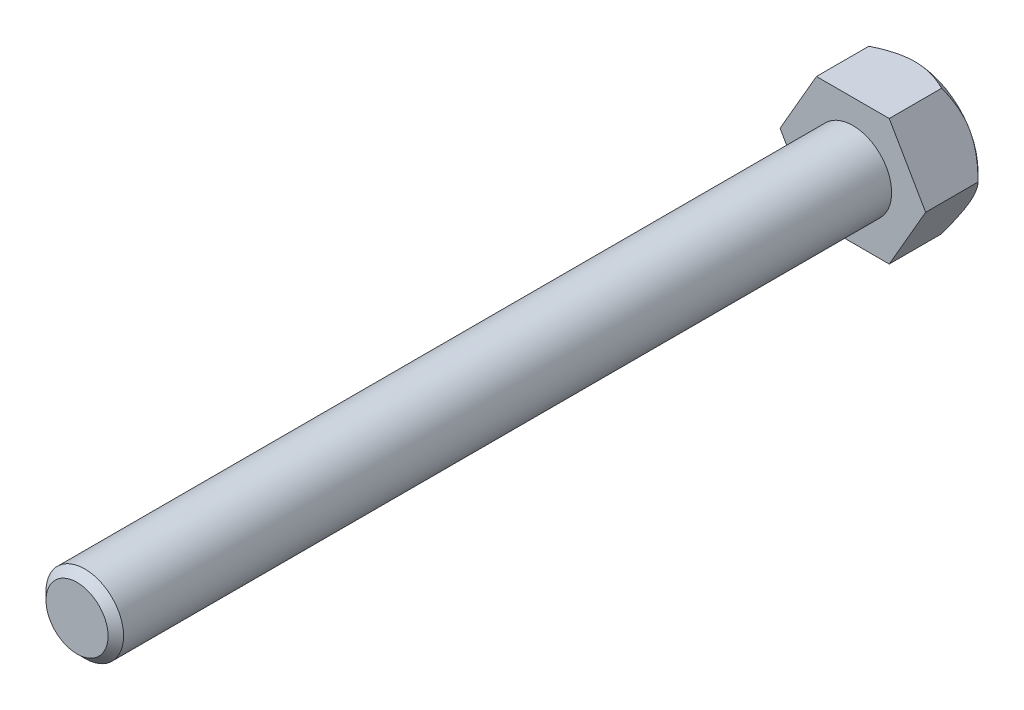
ISO-10303-21;
HEADER;
FILE_DESCRIPTION(('STEP AP214'),'2;1');
FILE_NAME('part.step','',(''),(''),'','','');
FILE_SCHEMA(('AUTOMOTIVE_DESIGN { 1 0 10303 214 1 1 1 1 }'));
ENDSEC;
DATA;
#1=APPLICATION_CONTEXT('core data for automotive mechanical design processes');
#2=APPLICATION_PROTOCOL_DEFINITION('international standard','automotive_design',2000,#1);
#3=PRODUCT_CONTEXT('',#1,'mechanical');
#4=PRODUCT('Part','Part','',(#3));
#5=PRODUCT_RELATED_PRODUCT_CATEGORY('part','',(#4));
#6=PRODUCT_DEFINITION_FORMATION('','',#4);
#7=PRODUCT_DEFINITION_CONTEXT('part definition',#1,'design');
#8=PRODUCT_DEFINITION('design','',#6,#7);
#9=PRODUCT_DEFINITION_SHAPE('','',#8);
#10=(LENGTH_UNIT() NAMED_UNIT(*) SI_UNIT(.MILLI.,.METRE.));
#11=(NAMED_UNIT(*) PLANE_ANGLE_UNIT() SI_UNIT($,.RADIAN.));
#12=(NAMED_UNIT(*) SI_UNIT($,.STERADIAN.) SOLID_ANGLE_UNIT());
#13=UNCERTAINTY_MEASURE_WITH_UNIT(LENGTH_MEASURE(1.E-05),#10,'distance_accuracy_value','');
#14=(GEOMETRIC_REPRESENTATION_CONTEXT(3) GLOBAL_UNCERTAINTY_ASSIGNED_CONTEXT((#13)) GLOBAL_UNIT_ASSIGNED_CONTEXT((#10,
#11,#12)) REPRESENTATION_CONTEXT('',''));
#15=CARTESIAN_POINT('',(0.,0.,0.));
#16=DIRECTION('',(0.,0.,1.));
#17=DIRECTION('',(1.,0.,0.));
#18=AXIS2_PLACEMENT_3D('',#15,#16,#17);
#19=CARTESIAN_POINT('',(3.75277674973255,-6.50000000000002,6.4));
#20=DIRECTION('',(-0.866025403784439,0.499999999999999,0.));
#21=DIRECTION('',(-0.499999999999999,-0.866025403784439,0.));
#22=AXIS2_PLACEMENT_3D('',#19,#20,#21);
#23=PLANE('',#22);
#24=CARTESIAN_POINT('',(10.1286443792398,4.54332667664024,4.5954038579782));
#25=CARTESIAN_POINT('',(10.039761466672,4.38937695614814,4.45131536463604));
#26=CARTESIAN_POINT('',(9.95052655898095,4.23481756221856,4.30808756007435));
#27=CARTESIAN_POINT('',(9.77123095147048,3.92426846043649,4.023682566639));
#28=CARTESIAN_POINT('',(9.68117017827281,3.76827862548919,3.88250556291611));
#29=CARTESIAN_POINT('',(9.49990390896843,3.45431623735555,3.60222798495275));
#30=CARTESIAN_POINT('',(9.40869621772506,3.29633988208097,3.46313307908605));
#31=CARTESIAN_POINT('',(9.2252068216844,2.9785269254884,3.18781210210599));
#32=CARTESIAN_POINT('',(9.13292514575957,2.81869037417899,3.05158595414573));
#33=CARTESIAN_POINT('',(8.94456358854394,2.49243858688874,2.77884830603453));
#34=CARTESIAN_POINT('',(8.84844908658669,2.3259633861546,2.64243221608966));
#35=CARTESIAN_POINT('',(8.65470525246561,1.99038922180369,2.37397618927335));
#36=CARTESIAN_POINT('',(8.5570759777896,1.82129035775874,2.24193608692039));
#37=CARTESIAN_POINT('',(8.36013893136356,1.4801853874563,1.98331100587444));
#38=CARTESIAN_POINT('',(8.26083264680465,1.30818185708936,1.85672151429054));
#39=CARTESIAN_POINT('',(8.0601982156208,0.960672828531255,1.61014921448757));
#40=CARTESIAN_POINT('',(7.95887032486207,0.785167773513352,1.49016557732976));
#41=CARTESIAN_POINT('',(7.75111491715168,0.425324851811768,1.25527867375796));
#42=CARTESIAN_POINT('',(7.64462356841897,0.240876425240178,1.14059973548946));
#43=CARTESIAN_POINT('',(7.42883796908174,-0.132875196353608,0.922141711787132));
#44=CARTESIAN_POINT('',(7.31954332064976,-0.322179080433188,0.818364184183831));
#45=CARTESIAN_POINT('',(7.09850568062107,-0.705027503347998,0.625122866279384));
#46=CARTESIAN_POINT('',(6.98677906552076,-0.898543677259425,0.535584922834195));
#47=CARTESIAN_POINT('',(6.7602534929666,-1.29089747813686,0.373601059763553));
#48=CARTESIAN_POINT('',(6.64545547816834,-1.48973347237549,0.301149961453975));
#49=CARTESIAN_POINT('',(6.43587432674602,-1.85273867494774,0.189275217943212));
#50=CARTESIAN_POINT('',(6.3415866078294,-2.0160497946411,0.14615995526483));
#51=CARTESIAN_POINT('',(6.15157362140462,-2.34516194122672,0.0752392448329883));
#52=CARTESIAN_POINT('',(6.05584856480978,-2.51096260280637,0.0474315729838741));
#53=CARTESIAN_POINT('',(5.86371262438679,-2.84375181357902,0.0085538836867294));
#54=CARTESIAN_POINT('',(5.7673032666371,-3.01073771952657,-0.00254587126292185));
#55=CARTESIAN_POINT('',(5.57437094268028,-3.34490630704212,-0.00749252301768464));
#56=CARTESIAN_POINT('',(5.47784797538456,-3.51208899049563,-0.00133925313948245));
#57=CARTESIAN_POINT('',(5.2856965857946,-3.8449049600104,0.027841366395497));
#58=CARTESIAN_POINT('',(5.19006652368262,-4.01054108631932,0.0508262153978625));
#59=CARTESIAN_POINT('',(5.00008490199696,-4.33959890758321,0.112436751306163));
#60=CARTESIAN_POINT('',(4.90573344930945,-4.5030204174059,0.151063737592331));
#61=CARTESIAN_POINT('',(4.71846263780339,-4.82738297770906,0.242364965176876));
#62=CARTESIAN_POINT('',(4.62554849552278,-4.98831499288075,0.295081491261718));
#63=CARTESIAN_POINT('',(4.44167070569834,-5.30680066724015,0.412553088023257));
#64=CARTESIAN_POINT('',(4.35070696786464,-5.4643544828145,0.477307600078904));
#65=CARTESIAN_POINT('',(4.13900239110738,-5.83103756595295,0.641610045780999));
#66=CARTESIAN_POINT('',(4.01908237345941,-6.03874512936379,0.745371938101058));
#67=CARTESIAN_POINT('',(3.78262258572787,-6.44830549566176,0.967414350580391));
#68=CARTESIAN_POINT('',(3.66608473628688,-6.65015497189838,1.08570292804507));
#69=CARTESIAN_POINT('',(3.43582542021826,-7.04897580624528,1.33378668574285));
#70=CARTESIAN_POINT('',(3.32211026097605,-7.24593623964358,1.46360510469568));
#71=CARTESIAN_POINT('',(3.09735084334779,-7.63523097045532,1.73203397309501));
#72=CARTESIAN_POINT('',(2.98630610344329,-7.82756610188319,1.87064282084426));
#73=CARTESIAN_POINT('',(2.76596059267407,-8.2092157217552,2.15547245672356));
#74=CARTESIAN_POINT('',(2.65667036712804,-8.39851194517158,2.30172572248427));
#75=CARTESIAN_POINT('',(2.44001623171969,-8.77376791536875,2.59982788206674));
#76=CARTESIAN_POINT('',(2.33265239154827,-8.95972754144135,2.75167697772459));
#77=CARTESIAN_POINT('',(2.11967159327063,-9.32862110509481,3.05972608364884));
#78=CARTESIAN_POINT('',(2.01405293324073,-9.51155799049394,3.21592140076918));
#79=CARTESIAN_POINT('',(1.80420589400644,-9.87502372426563,3.53198602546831));
#80=CARTESIAN_POINT('',(1.69997748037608,-10.0555526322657,3.69185524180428));
#81=CARTESIAN_POINT('',(1.5177627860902,-10.3711577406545,3.97561023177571));
#82=CARTESIAN_POINT('',(1.4395245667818,-10.5066703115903,4.09885061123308));
#83=CARTESIAN_POINT('',(1.28399947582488,-10.7760476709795,4.34631576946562));
#84=CARTESIAN_POINT('',(1.20670993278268,-10.9099170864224,4.47053382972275));
#85=CARTESIAN_POINT('',(1.12968586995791,-11.0433266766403,4.59540385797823));
#86=B_SPLINE_CURVE_WITH_KNOTS('',3,(#24,#25,#26,#27,#28,#29,#30,#31,#32,#33,#34,#35,#36,#37,#38,
#39,#40,#41,#42,#43,#44,#45,#46,#47,#48,#49,#50,#51,#52,#53,#54,#55,#56,#57,#58,#59,#60,#61,#62,
#63,#64,#65,#66,#67,#68,#69,#70,#71,#72,#73,#74,#75,#76,#77,#78,#79,#80,#81,#82,#83,#84,#85),
.UNSPECIFIED.,.F.,.F.,(4,2,2,2,2,2,2,2,2,2,2,2,2,2,2,2,2,2,2,2,2,2,2,2,2,2,2,2,2,2,4),(0.,
0.68648817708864,1.37303795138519,2.06120340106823,2.749350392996,3.45644398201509,
4.16351080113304,4.86998047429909,5.57636129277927,6.30179544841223,7.02733312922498,
7.74895922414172,8.47036632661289,9.05013970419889,9.62982882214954,10.2084849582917,
10.7871466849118,11.3643522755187,11.941605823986,12.52061163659,13.0995905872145,
13.8829026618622,14.6666511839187,15.4520168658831,16.2372398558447,17.0261239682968,
17.8150365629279,18.6031280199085,19.3911999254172,19.9887336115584,20.5836377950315),.UNSPECIFIED.);
#87=CARTESIAN_POINT('',(7.50555349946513,0.,0.99999999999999));
#88=VERTEX_POINT('',#87);
#89=CARTESIAN_POINT('',(5.76353991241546,-3.01725604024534,0.));
#90=VERTEX_POINT('',#89);
#91=EDGE_CURVE('E215',#88,#90,#86,.T.);
#92=ORIENTED_EDGE('',*,*,#91,.F.);
#93=DIRECTION('',(0.,0.,-1.));
#94=VECTOR('',#93,1.);
#95=CARTESIAN_POINT('',(7.50555349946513,0.,6.4));
#96=LINE('',#95,#94);
#97=CARTESIAN_POINT('',(7.50555349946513,0.,6.4));
#98=VERTEX_POINT('',#97);
#99=EDGE_CURVE('E161',#98,#88,#96,.T.);
#100=ORIENTED_EDGE('',*,*,#99,.F.);
#101=DIRECTION('',(0.499999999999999,0.866025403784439,0.));
#102=VECTOR('',#101,1.);
#103=CARTESIAN_POINT('',(3.75277674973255,-6.50000000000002,6.4));
#104=LINE('',#103,#102);
#105=CARTESIAN_POINT('',(3.75277674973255,-6.50000000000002,6.4));
#106=VERTEX_POINT('',#105);
#107=EDGE_CURVE('E193',#106,#98,#104,.T.);
#108=ORIENTED_EDGE('',*,*,#107,.F.);
#109=DIRECTION('',(0.,0.,-1.));
#110=VECTOR('',#109,1.);
#111=CARTESIAN_POINT('',(3.75277674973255,-6.50000000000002,6.4));
#112=LINE('',#111,#110);
#113=CARTESIAN_POINT('',(3.75277674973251,-6.50000000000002,0.99999999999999));
#114=VERTEX_POINT('',#113);
#115=EDGE_CURVE('E155',#106,#114,#112,.T.);
#116=ORIENTED_EDGE('',*,*,#115,.T.);
#117=CARTESIAN_POINT('',(5.49479033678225,-3.48274395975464,0.));
#118=VERTEX_POINT('',#117);
#119=EDGE_CURVE('E129',#118,#114,#86,.T.);
#120=ORIENTED_EDGE('',*,*,#119,.F.);
#121=DIRECTION('',(0.499999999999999,0.866025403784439,0.));
#122=VECTOR('',#121,1.);
#123=CARTESIAN_POINT('',(3.75277674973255,-6.50000000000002,0.));
#124=LINE('',#123,#122);
#125=EDGE_CURVE('E212',#118,#90,#124,.T.);
#126=ORIENTED_EDGE('',*,*,#125,.T.);
#127=EDGE_LOOP('',(#92,#100,#108,#116,#120,#126));
#128=FACE_BOUND('',#127,.T.);
#129=ADVANCED_FACE('F31',(#128),#23,.F.);
#130=CARTESIAN_POINT('',(7.50555349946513,0.,6.4));
#131=DIRECTION('',(-0.866025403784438,-0.500000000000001,0.));
#132=DIRECTION('',(0.500000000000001,-0.866025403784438,0.));
#133=AXIS2_PLACEMENT_3D('',#130,#131,#132);
#134=PLANE('',#133);
#135=CARTESIAN_POINT('',(1.12968586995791,11.0433266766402,4.59540385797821));
#136=CARTESIAN_POINT('',(1.21856878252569,10.8893769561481,4.45131536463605));
#137=CARTESIAN_POINT('',(1.30780369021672,10.7348175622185,4.30808756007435));
#138=CARTESIAN_POINT('',(1.4870992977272,10.4242684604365,4.023682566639));
#139=CARTESIAN_POINT('',(1.57716007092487,10.2682786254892,3.88250556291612));
#140=CARTESIAN_POINT('',(1.75842634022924,9.95431623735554,3.60222798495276));
#141=CARTESIAN_POINT('',(1.84963403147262,9.79633988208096,3.46313307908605));
#142=CARTESIAN_POINT('',(2.03312342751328,9.4785269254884,3.187812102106));
#143=CARTESIAN_POINT('',(2.12540510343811,9.31869037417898,3.05158595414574));
#144=CARTESIAN_POINT('',(2.31376666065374,8.99243858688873,2.77884830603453));
#145=CARTESIAN_POINT('',(2.40988116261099,8.82596338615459,2.64243221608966));
#146=CARTESIAN_POINT('',(2.60362499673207,8.49038922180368,2.37397618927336));
#147=CARTESIAN_POINT('',(2.70125427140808,8.32129035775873,2.2419360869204));
#148=CARTESIAN_POINT('',(2.89819131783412,7.98018538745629,1.98331100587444));
#149=CARTESIAN_POINT('',(2.99749760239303,7.80818185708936,1.85672151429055));
#150=CARTESIAN_POINT('',(3.19813203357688,7.46067282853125,1.61014921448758));
#151=CARTESIAN_POINT('',(3.29945992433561,7.28516777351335,1.49016557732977));
#152=CARTESIAN_POINT('',(3.507215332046,6.92532485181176,1.25527867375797));
#153=CARTESIAN_POINT('',(3.61370668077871,6.74087642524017,1.14059973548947));
#154=CARTESIAN_POINT('',(3.82949228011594,6.36712480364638,0.922141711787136));
#155=CARTESIAN_POINT('',(3.93878692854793,6.17782091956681,0.818364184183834));
#156=CARTESIAN_POINT('',(4.15982456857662,5.79497249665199,0.625122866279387));
#157=CARTESIAN_POINT('',(4.27155118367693,5.60145632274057,0.535584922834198));
#158=CARTESIAN_POINT('',(4.49807675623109,5.20910252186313,0.373601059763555));
#159=CARTESIAN_POINT('',(4.61287477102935,5.0102665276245,0.301149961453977));
#160=CARTESIAN_POINT('',(4.82245592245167,4.64726132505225,0.189275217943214));
#161=CARTESIAN_POINT('',(4.91674364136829,4.48395020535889,0.146159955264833));
#162=CARTESIAN_POINT('',(5.10675662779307,4.15483805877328,0.0752392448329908));
#163=CARTESIAN_POINT('',(5.20248168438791,3.98903739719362,0.047431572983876));
#164=CARTESIAN_POINT('',(5.3946176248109,3.65624818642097,0.00855388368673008));
#165=CARTESIAN_POINT('',(5.49102698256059,3.48926228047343,-0.00254587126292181));
#166=CARTESIAN_POINT('',(5.68395930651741,3.15509369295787,-0.00749252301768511));
#167=CARTESIAN_POINT('',(5.78048227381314,2.98791100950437,-0.00133925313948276));
#168=CARTESIAN_POINT('',(5.9726336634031,2.6550950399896,0.0278413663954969));
#169=CARTESIAN_POINT('',(6.06826372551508,2.48945891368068,0.0508262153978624));
#170=CARTESIAN_POINT('',(6.25824534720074,2.16040109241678,0.112436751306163));
#171=CARTESIAN_POINT('',(6.35259679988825,1.99697958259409,0.151063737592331));
#172=CARTESIAN_POINT('',(6.53986761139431,1.67261702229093,0.242364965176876));
#173=CARTESIAN_POINT('',(6.63278175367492,1.51168500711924,0.295081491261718));
#174=CARTESIAN_POINT('',(6.81665954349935,1.19319933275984,0.412553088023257));
#175=CARTESIAN_POINT('',(6.90762328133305,1.0356455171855,0.477307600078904));
#176=CARTESIAN_POINT('',(7.11932785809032,0.66896243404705,0.641610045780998));
#177=CARTESIAN_POINT('',(7.23924787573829,0.461254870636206,0.745371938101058));
#178=CARTESIAN_POINT('',(7.47570766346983,0.0516945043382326,0.96741435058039));
#179=CARTESIAN_POINT('',(7.59224551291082,-0.150154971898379,1.08570292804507));
#180=CARTESIAN_POINT('',(7.82250482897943,-0.548975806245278,1.33378668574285));
#181=CARTESIAN_POINT('',(7.93621998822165,-0.74593623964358,1.46360510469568));
#182=CARTESIAN_POINT('',(8.16097940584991,-1.13523097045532,1.732033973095));
#183=CARTESIAN_POINT('',(8.27202414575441,-1.32756610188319,1.87064282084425));
#184=CARTESIAN_POINT('',(8.49236965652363,-1.70921572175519,2.15547245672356));
#185=CARTESIAN_POINT('',(8.60165988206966,-1.89851194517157,2.30172572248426));
#186=CARTESIAN_POINT('',(8.81831401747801,-2.27376791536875,2.59982788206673));
#187=CARTESIAN_POINT('',(8.92567785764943,-2.45972754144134,2.75167697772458));
#188=CARTESIAN_POINT('',(9.13865865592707,-2.8286211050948,3.05972608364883));
#189=CARTESIAN_POINT('',(9.24427731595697,-3.01155799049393,3.21592140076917));
#190=CARTESIAN_POINT('',(9.45412435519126,-3.37502372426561,3.53198602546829));
#191=CARTESIAN_POINT('',(9.55835276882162,-3.55555263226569,3.69185524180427));
#192=CARTESIAN_POINT('',(9.7405674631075,-3.87115774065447,3.97561023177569));
#193=CARTESIAN_POINT('',(9.81880568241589,-4.00667031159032,4.09885061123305));
#194=CARTESIAN_POINT('',(9.97433077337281,-4.27604767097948,4.34631576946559));
#195=CARTESIAN_POINT('',(10.051620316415,-4.40991708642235,4.47053382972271));
#196=CARTESIAN_POINT('',(10.1286443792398,-4.54332667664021,4.59540385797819));
#197=B_SPLINE_CURVE_WITH_KNOTS('',3,(#135,#136,#137,#138,#139,#140,#141,#142,#143,#144,#145,
#146,#147,#148,#149,#150,#151,#152,#153,#154,#155,#156,#157,#158,#159,#160,#161,#162,#163,#164,
#165,#166,#167,#168,#169,#170,#171,#172,#173,#174,#175,#176,#177,#178,#179,#180,#181,#182,#183,
#184,#185,#186,#187,#188,#189,#190,#191,#192,#193,#194,#195,#196),.UNSPECIFIED.,.F.,.F.,(4,2,2,
2,2,2,2,2,2,2,2,2,2,2,2,2,2,2,2,2,2,2,2,2,2,2,2,2,2,2,4),(0.,0.686488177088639,1.37303795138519,
2.06120340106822,2.749350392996,3.45644398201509,4.16351080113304,4.86998047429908,
5.57636129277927,6.30179544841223,7.02733312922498,7.74895922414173,8.47036632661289,
9.05013970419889,9.62982882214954,10.2084849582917,10.7871466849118,11.3643522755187,
11.941605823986,12.52061163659,13.0995905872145,13.8829026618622,14.6666511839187,
15.4520168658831,16.2372398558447,17.0261239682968,17.8150365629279,18.6031280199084,
19.3911999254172,19.9887336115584,20.5836377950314),.UNSPECIFIED.);
#198=CARTESIAN_POINT('',(3.75277674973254,6.50000000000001,0.99999999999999));
#199=VERTEX_POINT('',#198);
#200=CARTESIAN_POINT('',(5.49479033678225,3.48274395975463,0.));
#201=VERTEX_POINT('',#200);
#202=EDGE_CURVE('E46',#199,#201,#197,.T.);
#203=ORIENTED_EDGE('',*,*,#202,.F.);
#204=DIRECTION('',(0.,0.,-1.));
#205=VECTOR('',#204,1.);
#206=CARTESIAN_POINT('',(3.75277674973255,6.50000000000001,6.4));
#207=LINE('',#206,#205);
#208=CARTESIAN_POINT('',(3.75277674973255,6.50000000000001,6.4));
#209=VERTEX_POINT('',#208);
#210=EDGE_CURVE('E152',#209,#199,#207,.T.);
#211=ORIENTED_EDGE('',*,*,#210,.F.);
#212=DIRECTION('',(-0.500000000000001,0.866025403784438,0.));
#213=VECTOR('',#212,1.);
#214=CARTESIAN_POINT('',(7.50555349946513,0.,6.4));
#215=LINE('',#214,#213);
#216=EDGE_CURVE('E415',#98,#209,#215,.T.);
#217=ORIENTED_EDGE('',*,*,#216,.F.);
#218=ORIENTED_EDGE('',*,*,#99,.T.);
#219=CARTESIAN_POINT('',(5.76353991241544,3.01725604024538,0.));
#220=VERTEX_POINT('',#219);
#221=EDGE_CURVE('E224',#220,#88,#197,.T.);
#222=ORIENTED_EDGE('',*,*,#221,.F.);
#223=DIRECTION('',(-0.500000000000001,0.866025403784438,0.));
#224=VECTOR('',#223,1.);
#225=CARTESIAN_POINT('',(7.50555349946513,0.,0.));
#226=LINE('',#225,#224);
#227=EDGE_CURVE('E214',#220,#201,#226,.T.);
#228=ORIENTED_EDGE('',*,*,#227,.T.);
#229=EDGE_LOOP('',(#203,#211,#217,#218,#222,#228));
#230=FACE_BOUND('',#229,.T.);
#231=ADVANCED_FACE('F273',(#230),#134,.F.);
#232=CARTESIAN_POINT('',(3.75277674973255,6.50000000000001,6.4));
#233=DIRECTION('',(0.,-1.,0.));
#234=DIRECTION('',(0.,0.,-1.));
#235=AXIS2_PLACEMENT_3D('',#232,#233,#234);
#236=PLANE('',#235);
#237=CARTESIAN_POINT('',(-8.29610342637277,6.50000000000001,4.03367474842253));
#238=CARTESIAN_POINT('',(-8.11036530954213,6.50000000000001,3.88749418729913));
#239=CARTESIAN_POINT('',(-7.92373684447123,6.50000000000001,3.74243045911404));
#240=CARTESIAN_POINT('',(-7.54835509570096,6.50000000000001,3.45501590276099));
#241=CARTESIAN_POINT('',(-7.3596014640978,6.50000000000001,3.31266552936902));
#242=CARTESIAN_POINT('',(-6.97873252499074,6.50000000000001,3.03049887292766));
#243=CARTESIAN_POINT('',(-6.78660509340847,6.50000000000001,2.89069891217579));
#244=CARTESIAN_POINT('',(-6.39953728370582,6.50000000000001,2.61506074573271));
#245=CARTESIAN_POINT('',(-6.2045970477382,6.50000000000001,2.47922234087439));
#246=CARTESIAN_POINT('',(-5.80175036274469,6.50000000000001,2.20578114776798));
#247=CARTESIAN_POINT('',(-5.59367836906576,6.50000000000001,2.06842132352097));
#248=CARTESIAN_POINT('',(-5.1732912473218,6.50000000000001,1.80027128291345));
#249=CARTESIAN_POINT('',(-4.96097565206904,6.50000000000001,1.66948179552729));
#250=CARTESIAN_POINT('',(-4.53185755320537,6.50000000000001,1.41642590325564));
#251=CARTESIAN_POINT('',(-4.31506466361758,6.50000000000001,1.29414328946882));
#252=CARTESIAN_POINT('',(-3.87593140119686,6.50000000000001,1.0600488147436));
#253=CARTESIAN_POINT('',(-3.65359273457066,6.50000000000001,0.948233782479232));
#254=CARTESIAN_POINT('',(-3.22593082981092,6.50000000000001,0.748732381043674));
#255=CARTESIAN_POINT('',(-3.02121813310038,6.50000000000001,0.659746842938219));
#256=CARTESIAN_POINT('',(-2.60646306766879,6.50000000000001,0.494978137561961));
#257=CARTESIAN_POINT('',(-2.39642019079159,6.50000000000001,0.41919623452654));
#258=CARTESIAN_POINT('',(-1.97356357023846,6.50000000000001,0.284533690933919));
#259=CARTESIAN_POINT('',(-1.76080909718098,6.50000000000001,0.225469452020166));
#260=CARTESIAN_POINT('',(-1.33093571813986,6.50000000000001,0.126016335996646));
#261=CARTESIAN_POINT('',(-1.11381737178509,6.50000000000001,0.0856250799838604));
#262=CARTESIAN_POINT('',(-0.672554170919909,6.50000000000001,0.0254289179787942));
#263=CARTESIAN_POINT('',(-0.448353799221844,6.50000000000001,0.00602217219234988));
#264=CARTESIAN_POINT('',(0.000845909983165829,6.50000000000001,-0.00942901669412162));
#265=CARTESIAN_POINT('',(0.225845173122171,6.50000000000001,-0.00547558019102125));
#266=CARTESIAN_POINT('',(0.674887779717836,6.50000000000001,0.0255358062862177));
#267=CARTESIAN_POINT('',(0.89892628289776,6.50000000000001,0.0526625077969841));
#268=CARTESIAN_POINT('',(1.34336613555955,6.50000000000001,0.128193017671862));
#269=CARTESIAN_POINT('',(1.56376649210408,6.50000000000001,0.176602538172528));
#270=CARTESIAN_POINT('',(2.06628953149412,6.50000000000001,0.309444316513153));
#271=CARTESIAN_POINT('',(2.34668289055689,6.50000000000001,0.400364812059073));
#272=CARTESIAN_POINT('',(2.89824997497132,6.50000000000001,0.606706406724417));
#273=CARTESIAN_POINT('',(3.16941809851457,6.50000000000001,0.722142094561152));
#274=CARTESIAN_POINT('',(3.70495151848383,6.50000000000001,0.972428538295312));
#275=CARTESIAN_POINT('',(3.96925216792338,6.50000000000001,1.10741575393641));
#276=CARTESIAN_POINT('',(4.49001736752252,6.50000000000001,1.39144955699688));
#277=CARTESIAN_POINT('',(4.7464837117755,6.50000000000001,1.54049289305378));
#278=CARTESIAN_POINT('',(5.29071545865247,6.50000000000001,1.87229908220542));
#279=CARTESIAN_POINT('',(5.57743102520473,6.50000000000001,2.05677257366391));
#280=CARTESIAN_POINT('',(6.14392762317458,6.50000000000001,2.43612707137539));
#281=CARTESIAN_POINT('',(6.42370706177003,6.50000000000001,2.63101043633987));
#282=CARTESIAN_POINT('',(6.97140928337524,6.50000000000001,3.02413880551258));
#283=CARTESIAN_POINT('',(7.23945723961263,6.50000000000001,3.22221013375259));
#284=CARTESIAN_POINT('',(7.63813759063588,6.50000000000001,3.52358491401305));
#285=CARTESIAN_POINT('',(7.77042024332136,6.50000000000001,3.62471846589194));
#286=CARTESIAN_POINT('',(8.03398507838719,6.50000000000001,3.82827059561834));
#287=CARTESIAN_POINT('',(8.1652673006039,6.50000000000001,3.93068912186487));
#288=CARTESIAN_POINT('',(8.29610342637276,6.50000000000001,4.03367474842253));
#289=B_SPLINE_CURVE_WITH_KNOTS('',3,(#237,#238,#239,#240,#241,#242,#243,#244,#245,#246,#247,
#248,#249,#250,#251,#252,#253,#254,#255,#256,#257,#258,#259,#260,#261,#262,#263,#264,#265,#266,
#267,#268,#269,#270,#271,#272,#273,#274,#275,#276,#277,#278,#279,#280,#281,#282,#283,#284,#285,
#286,#287,#288),.UNSPECIFIED.,.F.,.F.,(4,2,2,2,2,2,2,2,2,2,2,2,2,2,2,2,2,2,2,2,2,2,2,2,2,4),(0.,
0.709097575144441,1.41831297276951,2.13109111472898,2.8438333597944,3.59170118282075,
4.33965179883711,5.0861358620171,5.83239302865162,6.50167333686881,7.17101769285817,
7.83269743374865,8.49429285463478,9.16823229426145,9.84211056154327,10.5179950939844,
11.1940611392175,12.0768086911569,12.9600830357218,13.8498492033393,14.7394100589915,
15.7619006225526,16.7846238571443,17.7843881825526,18.2839221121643,18.7834360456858),.UNSPECIFIED.);
#290=CARTESIAN_POINT('',(-3.75277674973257,6.49999999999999,0.99999999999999));
#291=VERTEX_POINT('',#290);
#292=CARTESIAN_POINT('',(-0.268749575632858,6.50000000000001,0.));
#293=VERTEX_POINT('',#292);
#294=EDGE_CURVE('E54',#291,#293,#289,.T.);
#295=ORIENTED_EDGE('',*,*,#294,.F.);
#296=DIRECTION('',(0.,0.,-1.));
#297=VECTOR('',#296,1.);
#298=CARTESIAN_POINT('',(-3.75277674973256,6.50000000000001,6.4));
#299=LINE('',#298,#297);
#300=CARTESIAN_POINT('',(-3.75277674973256,6.50000000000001,6.4));
#301=VERTEX_POINT('',#300);
#302=EDGE_CURVE('E148',#301,#291,#299,.T.);
#303=ORIENTED_EDGE('',*,*,#302,.F.);
#304=DIRECTION('',(-1.,0.,0.));
#305=VECTOR('',#304,1.);
#306=CARTESIAN_POINT('',(3.75277674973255,6.50000000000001,6.4));
#307=LINE('',#306,#305);
#308=EDGE_CURVE('E416',#209,#301,#307,.T.);
#309=ORIENTED_EDGE('',*,*,#308,.F.);
#310=ORIENTED_EDGE('',*,*,#210,.T.);
#311=CARTESIAN_POINT('',(0.268749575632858,6.50000000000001,0.));
#312=VERTEX_POINT('',#311);
#313=EDGE_CURVE('E220',#312,#199,#289,.T.);
#314=ORIENTED_EDGE('',*,*,#313,.F.);
#315=DIRECTION('',(-1.,0.,0.));
#316=VECTOR('',#315,1.);
#317=CARTESIAN_POINT('',(3.75277674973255,6.50000000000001,0.));
#318=LINE('',#317,#316);
#319=EDGE_CURVE('E195',#312,#293,#318,.T.);
#320=ORIENTED_EDGE('',*,*,#319,.T.);
#321=EDGE_LOOP('',(#295,#303,#309,#310,#314,#320));
#322=FACE_BOUND('',#321,.T.);
#323=ADVANCED_FACE('F218',(#322),#236,.F.);
#324=CARTESIAN_POINT('',(-3.75277674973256,6.50000000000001,6.4));
#325=DIRECTION('',(0.866025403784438,-0.5,0.));
#326=DIRECTION('',(0.5,0.866025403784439,0.));
#327=AXIS2_PLACEMENT_3D('',#324,#325,#326);
#328=PLANE('',#327);
#329=CARTESIAN_POINT('',(-10.1286443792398,-4.54332667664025,4.59540385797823));
#330=CARTESIAN_POINT('',(-10.039761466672,-4.38937695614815,4.45131536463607));
#331=CARTESIAN_POINT('',(-9.95052655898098,-4.23481756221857,4.30808756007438));
#332=CARTESIAN_POINT('',(-9.77123095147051,-3.9242684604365,4.02368256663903));
#333=CARTESIAN_POINT('',(-9.68117017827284,-3.7682786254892,3.88250556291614));
#334=CARTESIAN_POINT('',(-9.49990390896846,-3.45431623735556,3.60222798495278));
#335=CARTESIAN_POINT('',(-9.40869621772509,-3.29633988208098,3.46313307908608));
#336=CARTESIAN_POINT('',(-9.22520682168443,-2.97852692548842,3.18781210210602));
#337=CARTESIAN_POINT('',(-9.13292514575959,-2.81869037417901,3.05158595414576));
#338=CARTESIAN_POINT('',(-8.94456358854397,-2.49243858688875,2.77884830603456));
#339=CARTESIAN_POINT('',(-8.84844908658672,-2.32596338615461,2.64243221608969));
#340=CARTESIAN_POINT('',(-8.65470525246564,-1.99038922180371,2.37397618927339));
#341=CARTESIAN_POINT('',(-8.55707597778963,-1.82129035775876,2.24193608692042));
#342=CARTESIAN_POINT('',(-8.36013893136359,-1.48018538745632,1.98331100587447));
#343=CARTESIAN_POINT('',(-8.26083264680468,-1.30818185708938,1.85672151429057));
#344=CARTESIAN_POINT('',(-8.06019821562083,-0.960672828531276,1.6101492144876));
#345=CARTESIAN_POINT('',(-7.9588703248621,-0.785167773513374,1.49016557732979));
#346=CARTESIAN_POINT('',(-7.75111491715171,-0.425324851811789,1.25527867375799));
#347=CARTESIAN_POINT('',(-7.644623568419,-0.240876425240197,1.14059973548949));
#348=CARTESIAN_POINT('',(-7.42883796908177,0.132875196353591,0.922141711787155));
#349=CARTESIAN_POINT('',(-7.31954332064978,0.322179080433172,0.818364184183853));
#350=CARTESIAN_POINT('',(-7.09850568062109,0.705027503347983,0.625122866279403));
#351=CARTESIAN_POINT('',(-6.98677906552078,0.898543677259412,0.535584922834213));
#352=CARTESIAN_POINT('',(-6.76025349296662,1.29089747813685,0.373601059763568));
#353=CARTESIAN_POINT('',(-6.64545547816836,1.48973347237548,0.30114996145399));
#354=CARTESIAN_POINT('',(-6.43587432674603,1.85273867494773,0.189275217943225));
#355=CARTESIAN_POINT('',(-6.34158660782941,2.01604979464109,0.146159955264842));
#356=CARTESIAN_POINT('',(-6.15157362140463,2.34516194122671,0.0752392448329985));
#357=CARTESIAN_POINT('',(-6.0558485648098,2.51096260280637,0.0474315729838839));
#358=CARTESIAN_POINT('',(-5.8637126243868,2.84375181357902,0.00855388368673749));
#359=CARTESIAN_POINT('',(-5.76730326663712,3.01073771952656,-0.00254587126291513));
#360=CARTESIAN_POINT('',(-5.57437094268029,3.34490630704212,-0.00749252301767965));
#361=CARTESIAN_POINT('',(-5.47784797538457,3.51208899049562,-0.00133925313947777));
#362=CARTESIAN_POINT('',(-5.28569658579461,3.84490496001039,0.0278413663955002));
#363=CARTESIAN_POINT('',(-5.19006652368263,4.01054108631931,0.0508262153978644));
#364=CARTESIAN_POINT('',(-5.00008490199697,4.33959890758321,0.112436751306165));
#365=CARTESIAN_POINT('',(-4.90573344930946,4.5030204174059,0.151063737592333));
#366=CARTESIAN_POINT('',(-4.71846263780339,4.82738297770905,0.242364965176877));
#367=CARTESIAN_POINT('',(-4.62554849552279,4.98831499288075,0.295081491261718));
#368=CARTESIAN_POINT('',(-4.44167070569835,5.30680066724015,0.412553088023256));
#369=CARTESIAN_POINT('',(-4.35070696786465,5.46435448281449,0.477307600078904));
#370=CARTESIAN_POINT('',(-4.13900239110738,5.83103756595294,0.641610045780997));
#371=CARTESIAN_POINT('',(-4.01908237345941,6.03874512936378,0.745371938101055));
#372=CARTESIAN_POINT('',(-3.78262258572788,6.44830549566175,0.967414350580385));
#373=CARTESIAN_POINT('',(-3.66608473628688,6.65015497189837,1.08570292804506));
#374=CARTESIAN_POINT('',(-3.43582542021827,7.04897580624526,1.33378668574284));
#375=CARTESIAN_POINT('',(-3.32211026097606,7.24593623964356,1.46360510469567));
#376=CARTESIAN_POINT('',(-3.0973508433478,7.6352309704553,1.73203397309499));
#377=CARTESIAN_POINT('',(-2.9863061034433,7.82756610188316,1.87064282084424));
#378=CARTESIAN_POINT('',(-2.76596059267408,8.20921572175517,2.15547245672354));
#379=CARTESIAN_POINT('',(-2.65667036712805,8.39851194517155,2.30172572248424));
#380=CARTESIAN_POINT('',(-2.4400162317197,8.77376791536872,2.59982788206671));
#381=CARTESIAN_POINT('',(-2.33265239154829,8.95972754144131,2.75167697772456));
#382=CARTESIAN_POINT('',(-2.11967159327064,9.32862110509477,3.05972608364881));
#383=CARTESIAN_POINT('',(-2.01405293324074,9.51155799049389,3.21592140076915));
#384=CARTESIAN_POINT('',(-1.80420589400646,9.87502372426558,3.53198602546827));
#385=CARTESIAN_POINT('',(-1.6999774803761,10.0555526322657,3.69185524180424));
#386=CARTESIAN_POINT('',(-1.51776278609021,10.3711577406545,3.97561023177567));
#387=CARTESIAN_POINT('',(-1.43952456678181,10.5066703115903,4.09885061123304));
#388=CARTESIAN_POINT('',(-1.28399947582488,10.7760476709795,4.34631576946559));
#389=CARTESIAN_POINT('',(-1.20670993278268,10.9099170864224,4.47053382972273));
#390=CARTESIAN_POINT('',(-1.12968586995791,11.0433266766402,4.59540385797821));
#391=B_SPLINE_CURVE_WITH_KNOTS('',3,(#329,#330,#331,#332,#333,#334,#335,#336,#337,#338,#339,
#340,#341,#342,#343,#344,#345,#346,#347,#348,#349,#350,#351,#352,#353,#354,#355,#356,#357,#358,
#359,#360,#361,#362,#363,#364,#365,#366,#367,#368,#369,#370,#371,#372,#373,#374,#375,#376,#377,
#378,#379,#380,#381,#382,#383,#384,#385,#386,#387,#388,#389,#390),.UNSPECIFIED.,.F.,.F.,(4,2,2,
2,2,2,2,2,2,2,2,2,2,2,2,2,2,2,2,2,2,2,2,2,2,2,2,2,2,2,4),(0.,0.68648817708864,1.37303795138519,
2.06120340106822,2.74935039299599,3.45644398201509,4.16351080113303,4.86998047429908,
5.57636129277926,6.30179544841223,7.02733312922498,7.74895922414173,8.4703663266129,
9.05013970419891,9.62982882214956,10.2084849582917,10.7871466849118,11.3643522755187,
11.941605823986,12.52061163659,13.0995905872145,13.8829026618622,14.6666511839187,
15.4520168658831,16.2372398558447,17.0261239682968,17.8150365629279,18.6031280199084,
19.3911999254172,19.9887336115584,20.5836377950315),.UNSPECIFIED.);
#392=CARTESIAN_POINT('',(-7.50555349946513,0.,0.99999999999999));
#393=VERTEX_POINT('',#392);
#394=CARTESIAN_POINT('',(-5.7635399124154,3.01725604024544,0.));
#395=VERTEX_POINT('',#394);
#396=EDGE_CURVE('E122',#393,#395,#391,.T.);
#397=ORIENTED_EDGE('',*,*,#396,.F.);
#398=DIRECTION('',(0.,0.,-1.));
#399=VECTOR('',#398,1.);
#400=CARTESIAN_POINT('',(-7.50555349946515,0.,6.4));
#401=LINE('',#400,#399);
#402=CARTESIAN_POINT('',(-7.50555349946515,0.,6.4));
#403=VERTEX_POINT('',#402);
#404=EDGE_CURVE('E137',#403,#393,#401,.T.);
#405=ORIENTED_EDGE('',*,*,#404,.F.);
#406=DIRECTION('',(-0.5,-0.866025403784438,0.));
#407=VECTOR('',#406,1.);
#408=CARTESIAN_POINT('',(-3.75277674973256,6.50000000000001,6.4));
#409=LINE('',#408,#407);
#410=EDGE_CURVE('E208',#301,#403,#409,.T.);
#411=ORIENTED_EDGE('',*,*,#410,.F.);
#412=ORIENTED_EDGE('',*,*,#302,.T.);
#413=CARTESIAN_POINT('',(-5.49479033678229,3.48274395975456,0.));
#414=VERTEX_POINT('',#413);
#415=EDGE_CURVE('E142',#414,#291,#391,.T.);
#416=ORIENTED_EDGE('',*,*,#415,.F.);
#417=DIRECTION('',(-0.5,-0.866025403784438,0.));
#418=VECTOR('',#417,1.);
#419=CARTESIAN_POINT('',(-3.75277674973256,6.50000000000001,0.));
#420=LINE('',#419,#418);
#421=EDGE_CURVE('E141',#414,#395,#420,.T.);
#422=ORIENTED_EDGE('',*,*,#421,.T.);
#423=EDGE_LOOP('',(#397,#405,#411,#412,#416,#422));
#424=FACE_BOUND('',#423,.T.);
#425=ADVANCED_FACE('F135',(#424),#328,.F.);
#426=CARTESIAN_POINT('',(-7.50555349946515,0.,6.4));
#427=DIRECTION('',(0.866025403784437,0.500000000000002,0.));
#428=DIRECTION('',(-0.500000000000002,0.866025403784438,0.));
#429=AXIS2_PLACEMENT_3D('',#426,#427,#428);
#430=PLANE('',#429);
#431=CARTESIAN_POINT('',(-1.12968586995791,-11.0433266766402,4.59540385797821));
#432=CARTESIAN_POINT('',(-1.21856878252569,-10.8893769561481,4.45131536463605));
#433=CARTESIAN_POINT('',(-1.30780369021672,-10.7348175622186,4.30808756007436));
#434=CARTESIAN_POINT('',(-1.4870992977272,-10.4242684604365,4.02368256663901));
#435=CARTESIAN_POINT('',(-1.57716007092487,-10.2682786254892,3.88250556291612));
#436=CARTESIAN_POINT('',(-1.75842634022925,-9.95431623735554,3.60222798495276));
#437=CARTESIAN_POINT('',(-1.84963403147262,-9.79633988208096,3.46313307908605));
#438=CARTESIAN_POINT('',(-2.03312342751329,-9.47852692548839,3.18781210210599));
#439=CARTESIAN_POINT('',(-2.12540510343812,-9.31869037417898,3.05158595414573));
#440=CARTESIAN_POINT('',(-2.31376666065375,-8.99243858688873,2.77884830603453));
#441=CARTESIAN_POINT('',(-2.409881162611,-8.82596338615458,2.64243221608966));
#442=CARTESIAN_POINT('',(-2.60362499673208,-8.49038922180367,2.37397618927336));
#443=CARTESIAN_POINT('',(-2.7012542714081,-8.32129035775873,2.24193608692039));
#444=CARTESIAN_POINT('',(-2.89819131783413,-7.98018538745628,1.98331100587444));
#445=CARTESIAN_POINT('',(-2.99749760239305,-7.80818185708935,1.85672151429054));
#446=CARTESIAN_POINT('',(-3.1981320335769,-7.46067282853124,1.61014921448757));
#447=CARTESIAN_POINT('',(-3.29945992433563,-7.28516777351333,1.49016557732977));
#448=CARTESIAN_POINT('',(-3.50721533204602,-6.92532485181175,1.25527867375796));
#449=CARTESIAN_POINT('',(-3.61370668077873,-6.74087642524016,1.14059973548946));
#450=CARTESIAN_POINT('',(-3.82949228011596,-6.36712480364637,0.922141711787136));
#451=CARTESIAN_POINT('',(-3.93878692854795,-6.17782091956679,0.818364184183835));
#452=CARTESIAN_POINT('',(-4.15982456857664,-5.79497249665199,0.62512286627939));
#453=CARTESIAN_POINT('',(-4.27155118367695,-5.60145632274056,0.535584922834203));
#454=CARTESIAN_POINT('',(-4.49807675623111,-5.20910252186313,0.373601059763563));
#455=CARTESIAN_POINT('',(-4.61287477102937,-5.0102665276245,0.301149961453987));
#456=CARTESIAN_POINT('',(-4.82245592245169,-4.64726132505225,0.189275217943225));
#457=CARTESIAN_POINT('',(-4.91674364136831,-4.48395020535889,0.146159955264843));
#458=CARTESIAN_POINT('',(-5.1067566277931,-4.15483805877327,0.0752392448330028));
#459=CARTESIAN_POINT('',(-5.20248168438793,-3.98903739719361,0.0474315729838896));
#460=CARTESIAN_POINT('',(-5.39461762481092,-3.65624818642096,0.00855388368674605));
#461=CARTESIAN_POINT('',(-5.49102698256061,-3.48926228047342,-0.00254587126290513));
#462=CARTESIAN_POINT('',(-5.68395930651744,-3.15509369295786,-0.00749252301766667));
#463=CARTESIAN_POINT('',(-5.78048227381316,-2.98791100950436,-0.00133925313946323));
#464=CARTESIAN_POINT('',(-5.97263366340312,-2.65509503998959,0.0278413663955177));
#465=CARTESIAN_POINT('',(-6.0682637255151,-2.48945891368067,0.0508262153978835));
#466=CARTESIAN_POINT('',(-6.25824534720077,-2.16040109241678,0.112436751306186));
#467=CARTESIAN_POINT('',(-6.35259679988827,-1.99697958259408,0.151063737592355));
#468=CARTESIAN_POINT('',(-6.53986761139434,-1.67261702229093,0.242364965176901));
#469=CARTESIAN_POINT('',(-6.63278175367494,-1.51168500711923,0.295081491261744));
#470=CARTESIAN_POINT('',(-6.81665954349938,-1.19319933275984,0.412553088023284));
#471=CARTESIAN_POINT('',(-6.90762328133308,-1.03564551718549,0.477307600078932));
#472=CARTESIAN_POINT('',(-7.11932785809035,-0.668962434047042,0.641610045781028));
#473=CARTESIAN_POINT('',(-7.23924787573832,-0.461254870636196,0.74537193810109));
#474=CARTESIAN_POINT('',(-7.47570766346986,-0.0516945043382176,0.967414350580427));
#475=CARTESIAN_POINT('',(-7.59224551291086,0.150154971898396,1.08570292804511));
#476=CARTESIAN_POINT('',(-7.82250482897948,0.548975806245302,1.3337866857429));
#477=CARTESIAN_POINT('',(-7.9362199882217,0.745936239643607,1.46360510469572));
#478=CARTESIAN_POINT('',(-8.16097940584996,1.13523097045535,1.73203397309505));
#479=CARTESIAN_POINT('',(-8.27202414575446,1.32756610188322,1.87064282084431));
#480=CARTESIAN_POINT('',(-8.49236965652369,1.70921572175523,2.15547245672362));
#481=CARTESIAN_POINT('',(-8.60165988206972,1.89851194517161,2.30172572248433));
#482=CARTESIAN_POINT('',(-8.81831401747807,2.2737679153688,2.5998278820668));
#483=CARTESIAN_POINT('',(-8.92567785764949,2.45972754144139,2.75167697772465));
#484=CARTESIAN_POINT('',(-9.13865865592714,2.82862110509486,3.05972608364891));
#485=CARTESIAN_POINT('',(-9.24427731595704,3.01155799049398,3.21592140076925));
#486=CARTESIAN_POINT('',(-9.45412435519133,3.37502372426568,3.53198602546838));
#487=CARTESIAN_POINT('',(-9.55835276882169,3.55555263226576,3.69185524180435));
#488=CARTESIAN_POINT('',(-9.74056746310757,3.87115774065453,3.97561023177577));
#489=CARTESIAN_POINT('',(-9.81880568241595,4.00667031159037,4.09885061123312));
#490=CARTESIAN_POINT('',(-9.97433077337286,4.27604767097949,4.34631576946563));
#491=CARTESIAN_POINT('',(-10.051620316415,4.40991708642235,4.47053382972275));
#492=CARTESIAN_POINT('',(-10.1286443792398,4.5433266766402,4.59540385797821));
#493=B_SPLINE_CURVE_WITH_KNOTS('',3,(#431,#432,#433,#434,#435,#436,#437,#438,#439,#440,#441,
#442,#443,#444,#445,#446,#447,#448,#449,#450,#451,#452,#453,#454,#455,#456,#457,#458,#459,#460,
#461,#462,#463,#464,#465,#466,#467,#468,#469,#470,#471,#472,#473,#474,#475,#476,#477,#478,#479,
#480,#481,#482,#483,#484,#485,#486,#487,#488,#489,#490,#491,#492),.UNSPECIFIED.,.F.,.F.,(4,2,2,
2,2,2,2,2,2,2,2,2,2,2,2,2,2,2,2,2,2,2,2,2,2,2,2,2,2,2,4),(0.,0.686488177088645,1.3730379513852,
2.06120340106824,2.74935039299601,3.45644398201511,4.16351080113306,4.86998047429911,
5.5763612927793,6.30179544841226,7.02733312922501,7.74895922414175,8.47036632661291,
9.05013970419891,9.62982882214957,10.2084849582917,10.7871466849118,11.3643522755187,
11.941605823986,12.52061163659,13.0995905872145,13.8829026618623,14.6666511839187,
15.4520168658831,16.2372398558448,17.0261239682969,17.815036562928,18.6031280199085,
19.3911999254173,19.9887336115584,20.5836377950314),.UNSPECIFIED.);
#494=CARTESIAN_POINT('',(-3.75277674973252,-6.50000000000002,0.99999999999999));
#495=VERTEX_POINT('',#494);
#496=CARTESIAN_POINT('',(-5.49479033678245,-3.48274395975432,0.));
#497=VERTEX_POINT('',#496);
#498=EDGE_CURVE('E131',#495,#497,#493,.T.);
#499=ORIENTED_EDGE('',*,*,#498,.F.);
#500=DIRECTION('',(0.,0.,-1.));
#501=VECTOR('',#500,1.);
#502=CARTESIAN_POINT('',(-3.75277674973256,-6.50000000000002,6.4));
#503=LINE('',#502,#501);
#504=CARTESIAN_POINT('',(-3.75277674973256,-6.50000000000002,6.4));
#505=VERTEX_POINT('',#504);
#506=EDGE_CURVE('E149',#505,#495,#503,.T.);
#507=ORIENTED_EDGE('',*,*,#506,.F.);
#508=DIRECTION('',(0.500000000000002,-0.866025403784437,0.));
#509=VECTOR('',#508,1.);
#510=CARTESIAN_POINT('',(-7.50555349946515,0.,6.4));
#511=LINE('',#510,#509);
#512=EDGE_CURVE('E147',#403,#505,#511,.T.);
#513=ORIENTED_EDGE('',*,*,#512,.F.);
#514=ORIENTED_EDGE('',*,*,#404,.T.);
#515=CARTESIAN_POINT('',(-5.76353991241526,-3.01725604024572,0.));
#516=VERTEX_POINT('',#515);
#517=EDGE_CURVE('E119',#516,#393,#493,.T.);
#518=ORIENTED_EDGE('',*,*,#517,.F.);
#519=DIRECTION('',(0.500000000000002,-0.866025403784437,0.));
#520=VECTOR('',#519,1.);
#521=CARTESIAN_POINT('',(-7.50555349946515,0.,0.));
#522=LINE('',#521,#520);
#523=EDGE_CURVE('E188',#516,#497,#522,.T.);
#524=ORIENTED_EDGE('',*,*,#523,.T.);
#525=EDGE_LOOP('',(#499,#507,#513,#514,#518,#524));
#526=FACE_BOUND('',#525,.T.);
#527=ADVANCED_FACE('F145',(#526),#430,.F.);
#528=CARTESIAN_POINT('',(-3.75277674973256,-6.50000000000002,6.4));
#529=DIRECTION('',(0.,1.,0.));
#530=DIRECTION('',(-1.,0.,0.));
#531=AXIS2_PLACEMENT_3D('',#528,#529,#530);
#532=PLANE('',#531);
#533=CARTESIAN_POINT('',(8.29610342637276,-6.50000000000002,4.03367474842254));
#534=CARTESIAN_POINT('',(8.11036530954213,-6.50000000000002,3.88749418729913));
#535=CARTESIAN_POINT('',(7.92373684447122,-6.50000000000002,3.74243045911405));
#536=CARTESIAN_POINT('',(7.54835509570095,-6.50000000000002,3.455015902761));
#537=CARTESIAN_POINT('',(7.35960146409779,-6.50000000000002,3.31266552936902));
#538=CARTESIAN_POINT('',(6.97873252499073,-6.50000000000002,3.03049887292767));
#539=CARTESIAN_POINT('',(6.78660509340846,-6.50000000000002,2.89069891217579));
#540=CARTESIAN_POINT('',(6.39953728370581,-6.50000000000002,2.61506074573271));
#541=CARTESIAN_POINT('',(6.20459704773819,-6.50000000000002,2.47922234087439));
#542=CARTESIAN_POINT('',(5.80175036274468,-6.50000000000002,2.20578114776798));
#543=CARTESIAN_POINT('',(5.59367836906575,-6.50000000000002,2.06842132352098));
#544=CARTESIAN_POINT('',(5.17329124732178,-6.50000000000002,1.80027128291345));
#545=CARTESIAN_POINT('',(4.96097565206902,-6.50000000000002,1.66948179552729));
#546=CARTESIAN_POINT('',(4.53185755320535,-6.50000000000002,1.41642590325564));
#547=CARTESIAN_POINT('',(4.31506466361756,-6.50000000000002,1.29414328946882));
#548=CARTESIAN_POINT('',(3.87593140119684,-6.50000000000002,1.06004881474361));
#549=CARTESIAN_POINT('',(3.65359273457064,-6.50000000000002,0.948233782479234));
#550=CARTESIAN_POINT('',(3.2259308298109,-6.50000000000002,0.748732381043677));
#551=CARTESIAN_POINT('',(3.02121813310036,-6.50000000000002,0.659746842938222));
#552=CARTESIAN_POINT('',(2.60646306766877,-6.50000000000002,0.494978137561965));
#553=CARTESIAN_POINT('',(2.39642019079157,-6.50000000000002,0.419196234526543));
#554=CARTESIAN_POINT('',(1.97356357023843,-6.50000000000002,0.284533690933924));
#555=CARTESIAN_POINT('',(1.76080909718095,-6.50000000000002,0.225469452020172));
#556=CARTESIAN_POINT('',(1.33093571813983,-6.50000000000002,0.126016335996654));
#557=CARTESIAN_POINT('',(1.11381737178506,-6.50000000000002,0.0856250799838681));
#558=CARTESIAN_POINT('',(0.672554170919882,-6.50000000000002,0.025428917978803));
#559=CARTESIAN_POINT('',(0.448353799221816,-6.50000000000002,0.00602217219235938));
#560=CARTESIAN_POINT('',(-0.00084590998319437,-6.50000000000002,-0.00942901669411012));
#561=CARTESIAN_POINT('',(-0.2258451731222,-6.50000000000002,-0.00547558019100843));
#562=CARTESIAN_POINT('',(-0.674887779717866,-6.50000000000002,0.0255358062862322));
#563=CARTESIAN_POINT('',(-0.898926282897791,-6.50000000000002,0.052662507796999));
#564=CARTESIAN_POINT('',(-1.34336613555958,-6.50000000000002,0.128193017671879));
#565=CARTESIAN_POINT('',(-1.56376649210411,-6.50000000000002,0.176602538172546));
#566=CARTESIAN_POINT('',(-2.06628953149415,-6.50000000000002,0.309444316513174));
#567=CARTESIAN_POINT('',(-2.34668289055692,-6.50000000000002,0.400364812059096));
#568=CARTESIAN_POINT('',(-2.89824997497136,-6.50000000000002,0.606706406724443));
#569=CARTESIAN_POINT('',(-3.16941809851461,-6.50000000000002,0.722142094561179));
#570=CARTESIAN_POINT('',(-3.70495151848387,-6.50000000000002,0.972428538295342));
#571=CARTESIAN_POINT('',(-3.96925216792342,-6.50000000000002,1.10741575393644));
#572=CARTESIAN_POINT('',(-4.49001736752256,-6.50000000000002,1.39144955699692));
#573=CARTESIAN_POINT('',(-4.74648371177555,-6.50000000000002,1.54049289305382));
#574=CARTESIAN_POINT('',(-5.29071545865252,-6.50000000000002,1.87229908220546));
#575=CARTESIAN_POINT('',(-5.57743102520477,-6.50000000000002,2.05677257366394));
#576=CARTESIAN_POINT('',(-6.14392762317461,-6.50000000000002,2.43612707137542));
#577=CARTESIAN_POINT('',(-6.42370706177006,-6.50000000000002,2.6310104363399));
#578=CARTESIAN_POINT('',(-6.97140928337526,-6.50000000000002,3.0241388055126));
#579=CARTESIAN_POINT('',(-7.23945723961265,-6.50000000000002,3.22221013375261));
#580=CARTESIAN_POINT('',(-7.63813759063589,-6.50000000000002,3.52358491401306));
#581=CARTESIAN_POINT('',(-7.77042024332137,-6.50000000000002,3.62471846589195));
#582=CARTESIAN_POINT('',(-8.0339850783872,-6.50000000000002,3.82827059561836));
#583=CARTESIAN_POINT('',(-8.1652673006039,-6.50000000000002,3.93068912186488));
#584=CARTESIAN_POINT('',(-8.29610342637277,-6.50000000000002,4.03367474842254));
#585=B_SPLINE_CURVE_WITH_KNOTS('',3,(#533,#534,#535,#536,#537,#538,#539,#540,#541,#542,#543,
#544,#545,#546,#547,#548,#549,#550,#551,#552,#553,#554,#555,#556,#557,#558,#559,#560,#561,#562,
#563,#564,#565,#566,#567,#568,#569,#570,#571,#572,#573,#574,#575,#576,#577,#578,#579,#580,#581,
#582,#583,#584),.UNSPECIFIED.,.F.,.F.,(4,2,2,2,2,2,2,2,2,2,2,2,2,2,2,2,2,2,2,2,2,2,2,2,2,4),(0.,
0.709097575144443,1.41831297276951,2.13109111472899,2.8438333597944,3.59170118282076,
4.33965179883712,5.08613586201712,5.83239302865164,6.50167333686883,7.17101769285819,
7.83269743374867,8.4942928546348,9.16823229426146,9.84211056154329,10.5179950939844,
11.1940611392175,12.0768086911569,12.9600830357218,13.8498492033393,14.7394100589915,
15.7619006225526,16.7846238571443,17.7843881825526,18.2839221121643,18.7834360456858),.UNSPECIFIED.);
#586=CARTESIAN_POINT('',(0.268749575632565,-6.50000000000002,0.));
#587=VERTEX_POINT('',#586);
#588=EDGE_CURVE('E270',#114,#587,#585,.T.);
#589=ORIENTED_EDGE('',*,*,#588,.F.);
#590=ORIENTED_EDGE('',*,*,#115,.F.);
#591=DIRECTION('',(1.,0.,0.));
#592=VECTOR('',#591,1.);
#593=CARTESIAN_POINT('',(-3.75277674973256,-6.50000000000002,6.4));
#594=LINE('',#593,#592);
#595=EDGE_CURVE('E199',#505,#106,#594,.T.);
#596=ORIENTED_EDGE('',*,*,#595,.F.);
#597=ORIENTED_EDGE('',*,*,#506,.T.);
#598=CARTESIAN_POINT('',(-0.268749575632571,-6.50000000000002,0.));
#599=VERTEX_POINT('',#598);
#600=EDGE_CURVE('E255',#599,#495,#585,.T.);
#601=ORIENTED_EDGE('',*,*,#600,.F.);
#602=DIRECTION('',(1.,0.,0.));
#603=VECTOR('',#602,1.);
#604=CARTESIAN_POINT('',(-3.75277674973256,-6.50000000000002,0.));
#605=LINE('',#604,#603);
#606=EDGE_CURVE('E189',#599,#587,#605,.T.);
#607=ORIENTED_EDGE('',*,*,#606,.T.);
#608=EDGE_LOOP('',(#589,#590,#596,#597,#601,#607));
#609=FACE_BOUND('',#608,.T.);
#610=ADVANCED_FACE('F286',(#609),#532,.F.);
#611=CARTESIAN_POINT('',(3.75277674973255,-6.50000000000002,0.));
#612=DIRECTION('',(0.,0.,-1.));
#613=DIRECTION('',(-1.,0.,0.));
#614=AXIS2_PLACEMENT_3D('',#611,#612,#613);
#615=PLANE('',#614);
#616=ORIENTED_EDGE('',*,*,#421,.F.);
#617=CARTESIAN_POINT('',(0.,0.,0.));
#618=DIRECTION('',(0.,0.,-1.));
#619=DIRECTION('',(-1.,0.,0.));
#620=AXIS2_PLACEMENT_3D('',#617,#618,#619);
#621=CIRCLE('',#620,6.50555349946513);
#622=EDGE_CURVE('E168',#414,#293,#621,.T.);
#623=ORIENTED_EDGE('',*,*,#622,.T.);
#624=ORIENTED_EDGE('',*,*,#319,.F.);
#625=EDGE_CURVE('E172',#312,#201,#621,.T.);
#626=ORIENTED_EDGE('',*,*,#625,.T.);
#627=ORIENTED_EDGE('',*,*,#227,.F.);
#628=EDGE_CURVE('E176',#220,#90,#621,.T.);
#629=ORIENTED_EDGE('',*,*,#628,.T.);
#630=ORIENTED_EDGE('',*,*,#125,.F.);
#631=EDGE_CURVE('E180',#118,#587,#621,.T.);
#632=ORIENTED_EDGE('',*,*,#631,.T.);
#633=ORIENTED_EDGE('',*,*,#606,.F.);
#634=EDGE_CURVE('E167',#599,#497,#621,.T.);
#635=ORIENTED_EDGE('',*,*,#634,.T.);
#636=ORIENTED_EDGE('',*,*,#523,.F.);
#637=EDGE_CURVE('E124',#516,#395,#621,.T.);
#638=ORIENTED_EDGE('',*,*,#637,.T.);
#639=EDGE_LOOP('',(#616,#623,#624,#626,#627,#629,#630,#632,#633,#635,#636,#638));
#640=FACE_BOUND('',#639,.T.);
#641=ADVANCED_FACE('F187',(#640),#615,.T.);
#642=CARTESIAN_POINT('',(3.75277674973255,-6.50000000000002,6.4));
#643=DIRECTION('',(0.,0.,-1.));
#644=DIRECTION('',(-1.,0.,0.));
#645=AXIS2_PLACEMENT_3D('',#642,#643,#644);
#646=PLANE('',#645);
#647=ORIENTED_EDGE('',*,*,#107,.T.);
#648=ORIENTED_EDGE('',*,*,#216,.T.);
#649=ORIENTED_EDGE('',*,*,#308,.T.);
#650=ORIENTED_EDGE('',*,*,#410,.T.);
#651=ORIENTED_EDGE('',*,*,#512,.T.);
#652=ORIENTED_EDGE('',*,*,#595,.T.);
#653=EDGE_LOOP('',(#647,#648,#649,#650,#651,#652));
#654=FACE_BOUND('',#653,.T.);
#655=CARTESIAN_POINT('',(0.,0.,6.4));
#656=DIRECTION('',(0.,0.,-1.));
#657=DIRECTION('',(-1.,0.,0.));
#658=AXIS2_PLACEMENT_3D('',#655,#656,#657);
#659=CIRCLE('',#658,4.);
#660=CARTESIAN_POINT('',(-4.,0.,6.4));
#661=VERTEX_POINT('',#660);
#662=EDGE_CURVE('E164',#661,#661,#659,.F.);
#663=ORIENTED_EDGE('',*,*,#662,.F.);
#664=EDGE_LOOP('',(#663));
#665=FACE_BOUND('',#664,.T.);
#666=ADVANCED_FACE('F331',(#654,#665),#646,.F.);
#667=CARTESIAN_POINT('',(0.,0.,86.4));
#668=DIRECTION('',(0.,0.,-1.));
#669=DIRECTION('',(-1.,0.,0.));
#670=AXIS2_PLACEMENT_3D('',#667,#668,#669);
#671=CYLINDRICAL_SURFACE('',#670,4.);
#672=CARTESIAN_POINT('',(0.,0.,85.6));
#673=DIRECTION('',(0.,0.,1.));
#674=DIRECTION('',(1.,0.,0.));
#675=AXIS2_PLACEMENT_3D('',#672,#673,#674);
#676=CIRCLE('',#675,4.);
#677=CARTESIAN_POINT('',(4.,0.,85.6));
#678=VERTEX_POINT('',#677);
#679=EDGE_CURVE('E11',#678,#678,#676,.F.);
#680=ORIENTED_EDGE('',*,*,#679,.T.);
#681=EDGE_LOOP('',(#680));
#682=FACE_BOUND('',#681,.T.);
#683=ORIENTED_EDGE('',*,*,#662,.T.);
#684=EDGE_LOOP('',(#683));
#685=FACE_BOUND('',#684,.T.);
#686=ADVANCED_FACE('F296',(#682,#685),#671,.T.);
#687=CARTESIAN_POINT('',(0.,0.,86.4));
#688=DIRECTION('',(0.,0.,1.));
#689=DIRECTION('',(1.,0.,0.));
#690=AXIS2_PLACEMENT_3D('',#687,#688,#689);
#691=PLANE('',#690);
#692=CARTESIAN_POINT('',(0.,0.,86.4));
#693=DIRECTION('',(0.,0.,1.));
#694=DIRECTION('',(1.,0.,0.));
#695=AXIS2_PLACEMENT_3D('',#692,#693,#694);
#696=CIRCLE('',#695,3.20000000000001);
#697=CARTESIAN_POINT('',(3.20000000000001,0.,86.4));
#698=VERTEX_POINT('',#697);
#699=EDGE_CURVE('E39',#698,#698,#696,.T.);
#700=ORIENTED_EDGE('',*,*,#699,.T.);
#701=EDGE_LOOP('',(#700));
#702=FACE_BOUND('',#701,.T.);
#703=ADVANCED_FACE('F250',(#702),#691,.T.);
#704=CARTESIAN_POINT('',(0.,0.,0.));
#705=DIRECTION('',(0.,0.,1.));
#706=DIRECTION('',(1.,0.,0.));
#707=AXIS2_PLACEMENT_3D('',#704,#705,#706);
#708=CONICAL_SURFACE('',#707,6.50555349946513,0.785398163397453);
#709=ORIENTED_EDGE('',*,*,#396,.T.);
#710=ORIENTED_EDGE('',*,*,#637,.F.);
#711=ORIENTED_EDGE('',*,*,#517,.T.);
#712=EDGE_LOOP('',(#709,#710,#711));
#713=FACE_BOUND('',#712,.T.);
#714=ADVANCED_FACE('F121',(#713),#708,.T.);
#715=ORIENTED_EDGE('',*,*,#498,.T.);
#716=ORIENTED_EDGE('',*,*,#634,.F.);
#717=ORIENTED_EDGE('',*,*,#600,.T.);
#718=EDGE_LOOP('',(#715,#716,#717));
#719=FACE_BOUND('',#718,.T.);
#720=ADVANCED_FACE('F249',(#719),#708,.T.);
#721=ORIENTED_EDGE('',*,*,#119,.T.);
#722=ORIENTED_EDGE('',*,*,#588,.T.);
#723=ORIENTED_EDGE('',*,*,#631,.F.);
#724=EDGE_LOOP('',(#721,#722,#723));
#725=FACE_BOUND('',#724,.T.);
#726=ADVANCED_FACE('F247',(#725),#708,.T.);
#727=ORIENTED_EDGE('',*,*,#91,.T.);
#728=ORIENTED_EDGE('',*,*,#628,.F.);
#729=ORIENTED_EDGE('',*,*,#221,.T.);
#730=EDGE_LOOP('',(#727,#728,#729));
#731=FACE_BOUND('',#730,.T.);
#732=ADVANCED_FACE('F242',(#731),#708,.T.);
#733=ORIENTED_EDGE('',*,*,#202,.T.);
#734=ORIENTED_EDGE('',*,*,#625,.F.);
#735=ORIENTED_EDGE('',*,*,#313,.T.);
#736=EDGE_LOOP('',(#733,#734,#735));
#737=FACE_BOUND('',#736,.T.);
#738=ADVANCED_FACE('F246',(#737),#708,.T.);
#739=ORIENTED_EDGE('',*,*,#294,.T.);
#740=ORIENTED_EDGE('',*,*,#622,.F.);
#741=ORIENTED_EDGE('',*,*,#415,.T.);
#742=EDGE_LOOP('',(#739,#740,#741));
#743=FACE_BOUND('',#742,.T.);
#744=ADVANCED_FACE('F292',(#743),#708,.T.);
#745=CARTESIAN_POINT('',(0.,0.,86.4));
#746=DIRECTION('',(0.,0.,-1.));
#747=DIRECTION('',(-1.,0.,0.));
#748=AXIS2_PLACEMENT_3D('',#745,#746,#747);
#749=CONICAL_SURFACE('',#748,3.20000000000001,0.785398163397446);
#750=ORIENTED_EDGE('',*,*,#679,.F.);
#751=EDGE_LOOP('',(#750));
#752=FACE_BOUND('',#751,.T.);
#753=ORIENTED_EDGE('',*,*,#699,.F.);
#754=EDGE_LOOP('',(#753));
#755=FACE_BOUND('',#754,.T.);
#756=ADVANCED_FACE('F33',(#752,#755),#749,.T.);
#757=CLOSED_SHELL('',(#129,#231,#323,#425,#527,#610,#641,#666,#686,#703,#714,#720,#726,#732,
#738,#744,#756));
#758=MANIFOLD_SOLID_BREP('B2',#757);
#759=ADVANCED_BREP_SHAPE_REPRESENTATION('',(#18,#758),#14);
#760=SHAPE_DEFINITION_REPRESENTATION(#9,#759);
ENDSEC;
END-ISO-10303-21;
